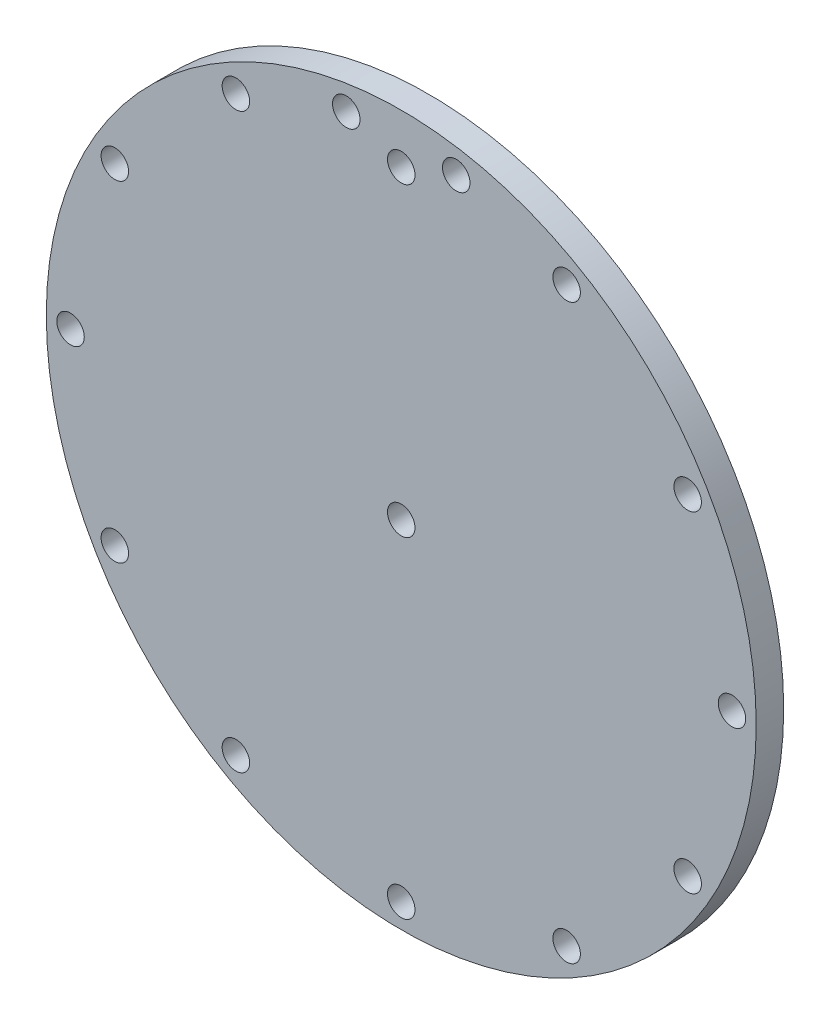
ISO-10303-21;
HEADER;
FILE_DESCRIPTION(('STEP AP214'),'2;1');
FILE_NAME('part.step','',(''),(''),'','','');
FILE_SCHEMA(('AUTOMOTIVE_DESIGN { 1 0 10303 214 1 1 1 1 }'));
ENDSEC;
DATA;
#1=APPLICATION_CONTEXT('core data for automotive mechanical design processes');
#2=APPLICATION_PROTOCOL_DEFINITION('international standard','automotive_design',2000,#1);
#3=PRODUCT_CONTEXT('',#1,'mechanical');
#4=PRODUCT('Part','Part','',(#3));
#5=PRODUCT_RELATED_PRODUCT_CATEGORY('part','',(#4));
#6=PRODUCT_DEFINITION_FORMATION('','',#4);
#7=PRODUCT_DEFINITION_CONTEXT('part definition',#1,'design');
#8=PRODUCT_DEFINITION('design','',#6,#7);
#9=PRODUCT_DEFINITION_SHAPE('','',#8);
#10=(LENGTH_UNIT() NAMED_UNIT(*) SI_UNIT(.MILLI.,.METRE.));
#11=(NAMED_UNIT(*) PLANE_ANGLE_UNIT() SI_UNIT($,.RADIAN.));
#12=(NAMED_UNIT(*) SI_UNIT($,.STERADIAN.) SOLID_ANGLE_UNIT());
#13=UNCERTAINTY_MEASURE_WITH_UNIT(LENGTH_MEASURE(1.E-05),#10,'distance_accuracy_value','');
#14=(GEOMETRIC_REPRESENTATION_CONTEXT(3) GLOBAL_UNCERTAINTY_ASSIGNED_CONTEXT((#13)) GLOBAL_UNIT_ASSIGNED_CONTEXT((#10,
#11,#12)) REPRESENTATION_CONTEXT('',''));
#15=CARTESIAN_POINT('',(0.,0.,0.));
#16=DIRECTION('',(0.,0.,1.));
#17=DIRECTION('',(1.,0.,0.));
#18=AXIS2_PLACEMENT_3D('',#15,#16,#17);
#19=CARTESIAN_POINT('',(0.,0.,3.175));
#20=DIRECTION('',(0.,0.,1.));
#21=DIRECTION('',(1.,0.,0.));
#22=AXIS2_PLACEMENT_3D('',#19,#20,#21);
#23=PLANE('',#22);
#24=CARTESIAN_POINT('',(6.35,37.6685213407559,3.175));
#25=DIRECTION('',(0.,0.,1.));
#26=DIRECTION('',(1.,0.,0.));
#27=AXIS2_PLACEMENT_3D('',#24,#25,#26);
#28=CIRCLE('',#27,1.5875000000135);
#29=CARTESIAN_POINT('',(7.9375000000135,37.6685213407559,3.175));
#30=VERTEX_POINT('',#29);
#31=EDGE_CURVE('E123',#30,#30,#28,.T.);
#32=ORIENTED_EDGE('',*,*,#31,.F.);
#33=EDGE_LOOP('',(#32));
#34=FACE_BOUND('',#33,.T.);
#35=CARTESIAN_POINT('',(33.0821704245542,19.0999999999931,3.175));
#36=DIRECTION('',(0.,0.,1.));
#37=DIRECTION('',(1.,0.,0.));
#38=AXIS2_PLACEMENT_3D('',#35,#36,#37);
#39=CIRCLE('',#38,1.5875000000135);
#40=CARTESIAN_POINT('',(34.6696704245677,19.0999999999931,3.175));
#41=VERTEX_POINT('',#40);
#42=EDGE_CURVE('E111',#41,#41,#39,.T.);
#43=ORIENTED_EDGE('',*,*,#42,.F.);
#44=EDGE_LOOP('',(#43));
#45=FACE_BOUND('',#44,.T.);
#46=CARTESIAN_POINT('',(-33.082170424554,19.0999999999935,3.175));
#47=DIRECTION('',(0.,0.,1.));
#48=DIRECTION('',(1.,0.,0.));
#49=AXIS2_PLACEMENT_3D('',#46,#47,#48);
#50=CIRCLE('',#49,1.58750000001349);
#51=CARTESIAN_POINT('',(-31.4946704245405,19.0999999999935,3.175));
#52=VERTEX_POINT('',#51);
#53=EDGE_CURVE('E99',#52,#52,#50,.T.);
#54=ORIENTED_EDGE('',*,*,#53,.F.);
#55=EDGE_LOOP('',(#54));
#56=FACE_BOUND('',#55,.T.);
#57=CARTESIAN_POINT('',(33.0821704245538,-19.0999999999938,3.175));
#58=DIRECTION('',(0.,0.,1.));
#59=DIRECTION('',(1.,0.,0.));
#60=AXIS2_PLACEMENT_3D('',#57,#58,#59);
#61=CIRCLE('',#60,1.58750000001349);
#62=CARTESIAN_POINT('',(34.6696704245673,-19.0999999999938,3.175));
#63=VERTEX_POINT('',#62);
#64=EDGE_CURVE('E87',#63,#63,#61,.T.);
#65=ORIENTED_EDGE('',*,*,#64,.F.);
#66=EDGE_LOOP('',(#65));
#67=FACE_BOUND('',#66,.T.);
#68=CARTESIAN_POINT('',(0.,-38.1999999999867,3.175));
#69=DIRECTION('',(0.,0.,1.));
#70=DIRECTION('',(1.,0.,0.));
#71=AXIS2_PLACEMENT_3D('',#68,#69,#70);
#72=CIRCLE('',#71,1.58750000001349);
#73=CARTESIAN_POINT('',(1.58750000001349,-38.1999999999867,3.175));
#74=VERTEX_POINT('',#73);
#75=EDGE_CURVE('E75',#74,#74,#72,.T.);
#76=ORIENTED_EDGE('',*,*,#75,.F.);
#77=EDGE_LOOP('',(#76));
#78=FACE_BOUND('',#77,.T.);
#79=CARTESIAN_POINT('',(-33.0821704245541,-19.0999999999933,3.175));
#80=DIRECTION('',(0.,0.,1.));
#81=DIRECTION('',(1.,0.,0.));
#82=AXIS2_PLACEMENT_3D('',#79,#80,#81);
#83=CIRCLE('',#82,1.58750000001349);
#84=CARTESIAN_POINT('',(-31.4946704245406,-19.0999999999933,3.175));
#85=VERTEX_POINT('',#84);
#86=EDGE_CURVE('E63',#85,#85,#83,.T.);
#87=ORIENTED_EDGE('',*,*,#86,.F.);
#88=EDGE_LOOP('',(#87));
#89=FACE_BOUND('',#88,.T.);
#90=CARTESIAN_POINT('',(0.,0.,3.175));
#91=DIRECTION('',(0.,0.,1.));
#92=DIRECTION('',(1.,0.,0.));
#93=AXIS2_PLACEMENT_3D('',#90,#91,#92);
#94=CIRCLE('',#93,1.5875);
#95=CARTESIAN_POINT('',(1.5875,0.,3.175));
#96=VERTEX_POINT('',#95);
#97=EDGE_CURVE('E51',#96,#96,#94,.T.);
#98=ORIENTED_EDGE('',*,*,#97,.F.);
#99=EDGE_LOOP('',(#98));
#100=FACE_BOUND('',#99,.T.);
#101=CARTESIAN_POINT('',(0.,0.,3.175));
#102=DIRECTION('',(0.,0.,1.));
#103=DIRECTION('',(1.,0.,0.));
#104=AXIS2_PLACEMENT_3D('',#101,#102,#103);
#105=CIRCLE('',#104,41.);
#106=CARTESIAN_POINT('',(41.,0.,3.175));
#107=VERTEX_POINT('',#106);
#108=EDGE_CURVE('E10',#107,#107,#105,.T.);
#109=ORIENTED_EDGE('',*,*,#108,.T.);
#110=EDGE_LOOP('',(#109));
#111=FACE_BOUND('',#110,.T.);
#112=CARTESIAN_POINT('',(0.,35.2924110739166,3.175));
#113=DIRECTION('',(0.,0.,1.));
#114=DIRECTION('',(1.,0.,0.));
#115=AXIS2_PLACEMENT_3D('',#112,#113,#114);
#116=CIRCLE('',#115,1.5875);
#117=CARTESIAN_POINT('',(1.5875,35.2924110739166,3.175));
#118=VERTEX_POINT('',#117);
#119=EDGE_CURVE('E46',#118,#118,#116,.T.);
#120=ORIENTED_EDGE('',*,*,#119,.F.);
#121=EDGE_LOOP('',(#120));
#122=FACE_BOUND('',#121,.T.);
#123=CARTESIAN_POINT('',(-38.1999999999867,1.33374587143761E-13,3.175));
#124=DIRECTION('',(0.,0.,1.));
#125=DIRECTION('',(1.,0.,0.));
#126=AXIS2_PLACEMENT_3D('',#123,#124,#125);
#127=CIRCLE('',#126,1.58750000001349);
#128=CARTESIAN_POINT('',(-36.6124999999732,1.33374587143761E-13,3.175));
#129=VERTEX_POINT('',#128);
#130=EDGE_CURVE('E57',#129,#129,#127,.T.);
#131=ORIENTED_EDGE('',*,*,#130,.F.);
#132=EDGE_LOOP('',(#131));
#133=FACE_BOUND('',#132,.T.);
#134=CARTESIAN_POINT('',(-19.0999999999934,-33.082170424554,3.175));
#135=DIRECTION('',(0.,0.,1.));
#136=DIRECTION('',(1.,0.,0.));
#137=AXIS2_PLACEMENT_3D('',#134,#135,#136);
#138=CIRCLE('',#137,1.58750000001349);
#139=CARTESIAN_POINT('',(-17.5124999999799,-33.082170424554,3.175));
#140=VERTEX_POINT('',#139);
#141=EDGE_CURVE('E69',#140,#140,#138,.T.);
#142=ORIENTED_EDGE('',*,*,#141,.F.);
#143=EDGE_LOOP('',(#142));
#144=FACE_BOUND('',#143,.T.);
#145=CARTESIAN_POINT('',(19.0999999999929,-33.0821704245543,3.175));
#146=DIRECTION('',(0.,0.,1.));
#147=DIRECTION('',(1.,0.,0.));
#148=AXIS2_PLACEMENT_3D('',#145,#146,#147);
#149=CIRCLE('',#148,1.58750000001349);
#150=CARTESIAN_POINT('',(20.6875000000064,-33.0821704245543,3.175));
#151=VERTEX_POINT('',#150);
#152=EDGE_CURVE('E81',#151,#151,#149,.T.);
#153=ORIENTED_EDGE('',*,*,#152,.F.);
#154=EDGE_LOOP('',(#153));
#155=FACE_BOUND('',#154,.T.);
#156=CARTESIAN_POINT('',(38.1999999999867,-4.00123761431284E-13,3.175));
#157=DIRECTION('',(0.,0.,1.));
#158=DIRECTION('',(1.,0.,0.));
#159=AXIS2_PLACEMENT_3D('',#156,#157,#158);
#160=CIRCLE('',#159,1.58750000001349);
#161=CARTESIAN_POINT('',(39.7875000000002,-4.00123761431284E-13,3.175));
#162=VERTEX_POINT('',#161);
#163=EDGE_CURVE('E93',#162,#162,#160,.T.);
#164=ORIENTED_EDGE('',*,*,#163,.F.);
#165=EDGE_LOOP('',(#164));
#166=FACE_BOUND('',#165,.T.);
#167=CARTESIAN_POINT('',(-19.0999999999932,33.0821704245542,3.175));
#168=DIRECTION('',(0.,0.,1.));
#169=DIRECTION('',(1.,0.,0.));
#170=AXIS2_PLACEMENT_3D('',#167,#168,#169);
#171=CIRCLE('',#170,1.5875000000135);
#172=CARTESIAN_POINT('',(-17.5124999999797,33.0821704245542,3.175));
#173=VERTEX_POINT('',#172);
#174=EDGE_CURVE('E105',#173,#173,#171,.T.);
#175=ORIENTED_EDGE('',*,*,#174,.F.);
#176=EDGE_LOOP('',(#175));
#177=FACE_BOUND('',#176,.T.);
#178=CARTESIAN_POINT('',(19.0999999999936,33.0821704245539,3.175));
#179=DIRECTION('',(0.,0.,1.));
#180=DIRECTION('',(1.,0.,0.));
#181=AXIS2_PLACEMENT_3D('',#178,#179,#180);
#182=CIRCLE('',#181,1.58750000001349);
#183=CARTESIAN_POINT('',(20.6875000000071,33.0821704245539,3.175));
#184=VERTEX_POINT('',#183);
#185=EDGE_CURVE('E117',#184,#184,#182,.T.);
#186=ORIENTED_EDGE('',*,*,#185,.F.);
#187=EDGE_LOOP('',(#186));
#188=FACE_BOUND('',#187,.T.);
#189=CARTESIAN_POINT('',(-6.35,37.6685213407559,3.175));
#190=DIRECTION('',(0.,0.,1.));
#191=DIRECTION('',(1.,0.,0.));
#192=AXIS2_PLACEMENT_3D('',#189,#190,#191);
#193=CIRCLE('',#192,1.58750000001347);
#194=CARTESIAN_POINT('',(-4.76249999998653,37.6685213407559,3.175));
#195=VERTEX_POINT('',#194);
#196=EDGE_CURVE('E129',#195,#195,#193,.T.);
#197=ORIENTED_EDGE('',*,*,#196,.F.);
#198=EDGE_LOOP('',(#197));
#199=FACE_BOUND('',#198,.T.);
#200=ADVANCED_FACE('F35',(#34,#45,#56,#67,#78,#89,#100,#111,#122,#133,#144,#155,#166,#177,#188,
#199),#23,.T.);
#201=CARTESIAN_POINT('',(0.,0.,0.));
#202=DIRECTION('',(0.,0.,1.));
#203=DIRECTION('',(1.,0.,0.));
#204=AXIS2_PLACEMENT_3D('',#201,#202,#203);
#205=PLANE('',#204);
#206=CARTESIAN_POINT('',(0.,0.,0.));
#207=DIRECTION('',(0.,0.,1.));
#208=DIRECTION('',(1.,0.,0.));
#209=AXIS2_PLACEMENT_3D('',#206,#207,#208);
#210=CIRCLE('',#209,41.);
#211=CARTESIAN_POINT('',(41.,0.,0.));
#212=VERTEX_POINT('',#211);
#213=EDGE_CURVE('E39',#212,#212,#210,.T.);
#214=ORIENTED_EDGE('',*,*,#213,.F.);
#215=EDGE_LOOP('',(#214));
#216=FACE_BOUND('',#215,.T.);
#217=CARTESIAN_POINT('',(0.,35.2924110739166,0.));
#218=DIRECTION('',(0.,0.,1.));
#219=DIRECTION('',(1.,0.,0.));
#220=AXIS2_PLACEMENT_3D('',#217,#218,#219);
#221=CIRCLE('',#220,1.5875);
#222=CARTESIAN_POINT('',(1.5875,35.2924110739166,0.));
#223=VERTEX_POINT('',#222);
#224=EDGE_CURVE('E48',#223,#223,#221,.T.);
#225=ORIENTED_EDGE('',*,*,#224,.T.);
#226=EDGE_LOOP('',(#225));
#227=FACE_BOUND('',#226,.T.);
#228=CARTESIAN_POINT('',(0.,0.,0.));
#229=DIRECTION('',(0.,0.,1.));
#230=DIRECTION('',(1.,0.,0.));
#231=AXIS2_PLACEMENT_3D('',#228,#229,#230);
#232=CIRCLE('',#231,1.5875);
#233=CARTESIAN_POINT('',(1.5875,0.,0.));
#234=VERTEX_POINT('',#233);
#235=EDGE_CURVE('E54',#234,#234,#232,.T.);
#236=ORIENTED_EDGE('',*,*,#235,.T.);
#237=EDGE_LOOP('',(#236));
#238=FACE_BOUND('',#237,.T.);
#239=CARTESIAN_POINT('',(-38.1999999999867,1.33374587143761E-13,0.));
#240=DIRECTION('',(0.,0.,1.));
#241=DIRECTION('',(1.,0.,0.));
#242=AXIS2_PLACEMENT_3D('',#239,#240,#241);
#243=CIRCLE('',#242,1.58750000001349);
#244=CARTESIAN_POINT('',(-36.6124999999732,1.33374587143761E-13,0.));
#245=VERTEX_POINT('',#244);
#246=EDGE_CURVE('E60',#245,#245,#243,.T.);
#247=ORIENTED_EDGE('',*,*,#246,.T.);
#248=EDGE_LOOP('',(#247));
#249=FACE_BOUND('',#248,.T.);
#250=CARTESIAN_POINT('',(-33.0821704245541,-19.0999999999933,0.));
#251=DIRECTION('',(0.,0.,1.));
#252=DIRECTION('',(1.,0.,0.));
#253=AXIS2_PLACEMENT_3D('',#250,#251,#252);
#254=CIRCLE('',#253,1.58750000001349);
#255=CARTESIAN_POINT('',(-31.4946704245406,-19.0999999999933,0.));
#256=VERTEX_POINT('',#255);
#257=EDGE_CURVE('E66',#256,#256,#254,.T.);
#258=ORIENTED_EDGE('',*,*,#257,.T.);
#259=EDGE_LOOP('',(#258));
#260=FACE_BOUND('',#259,.T.);
#261=CARTESIAN_POINT('',(-19.0999999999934,-33.082170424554,0.));
#262=DIRECTION('',(0.,0.,1.));
#263=DIRECTION('',(1.,0.,0.));
#264=AXIS2_PLACEMENT_3D('',#261,#262,#263);
#265=CIRCLE('',#264,1.58750000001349);
#266=CARTESIAN_POINT('',(-17.5124999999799,-33.082170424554,0.));
#267=VERTEX_POINT('',#266);
#268=EDGE_CURVE('E72',#267,#267,#265,.T.);
#269=ORIENTED_EDGE('',*,*,#268,.T.);
#270=EDGE_LOOP('',(#269));
#271=FACE_BOUND('',#270,.T.);
#272=CARTESIAN_POINT('',(0.,-38.1999999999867,0.));
#273=DIRECTION('',(0.,0.,1.));
#274=DIRECTION('',(1.,0.,0.));
#275=AXIS2_PLACEMENT_3D('',#272,#273,#274);
#276=CIRCLE('',#275,1.58750000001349);
#277=CARTESIAN_POINT('',(1.58750000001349,-38.1999999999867,0.));
#278=VERTEX_POINT('',#277);
#279=EDGE_CURVE('E78',#278,#278,#276,.T.);
#280=ORIENTED_EDGE('',*,*,#279,.T.);
#281=EDGE_LOOP('',(#280));
#282=FACE_BOUND('',#281,.T.);
#283=CARTESIAN_POINT('',(19.0999999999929,-33.0821704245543,0.));
#284=DIRECTION('',(0.,0.,1.));
#285=DIRECTION('',(1.,0.,0.));
#286=AXIS2_PLACEMENT_3D('',#283,#284,#285);
#287=CIRCLE('',#286,1.58750000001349);
#288=CARTESIAN_POINT('',(20.6875000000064,-33.0821704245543,0.));
#289=VERTEX_POINT('',#288);
#290=EDGE_CURVE('E84',#289,#289,#287,.T.);
#291=ORIENTED_EDGE('',*,*,#290,.T.);
#292=EDGE_LOOP('',(#291));
#293=FACE_BOUND('',#292,.T.);
#294=CARTESIAN_POINT('',(33.0821704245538,-19.0999999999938,0.));
#295=DIRECTION('',(0.,0.,1.));
#296=DIRECTION('',(1.,0.,0.));
#297=AXIS2_PLACEMENT_3D('',#294,#295,#296);
#298=CIRCLE('',#297,1.58750000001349);
#299=CARTESIAN_POINT('',(34.6696704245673,-19.0999999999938,0.));
#300=VERTEX_POINT('',#299);
#301=EDGE_CURVE('E90',#300,#300,#298,.T.);
#302=ORIENTED_EDGE('',*,*,#301,.T.);
#303=EDGE_LOOP('',(#302));
#304=FACE_BOUND('',#303,.T.);
#305=CARTESIAN_POINT('',(38.1999999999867,-4.00123761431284E-13,0.));
#306=DIRECTION('',(0.,0.,1.));
#307=DIRECTION('',(1.,0.,0.));
#308=AXIS2_PLACEMENT_3D('',#305,#306,#307);
#309=CIRCLE('',#308,1.58750000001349);
#310=CARTESIAN_POINT('',(39.7875000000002,-4.00123761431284E-13,0.));
#311=VERTEX_POINT('',#310);
#312=EDGE_CURVE('E96',#311,#311,#309,.T.);
#313=ORIENTED_EDGE('',*,*,#312,.T.);
#314=EDGE_LOOP('',(#313));
#315=FACE_BOUND('',#314,.T.);
#316=CARTESIAN_POINT('',(-33.082170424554,19.0999999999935,0.));
#317=DIRECTION('',(0.,0.,1.));
#318=DIRECTION('',(1.,0.,0.));
#319=AXIS2_PLACEMENT_3D('',#316,#317,#318);
#320=CIRCLE('',#319,1.58750000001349);
#321=CARTESIAN_POINT('',(-31.4946704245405,19.0999999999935,0.));
#322=VERTEX_POINT('',#321);
#323=EDGE_CURVE('E102',#322,#322,#320,.T.);
#324=ORIENTED_EDGE('',*,*,#323,.T.);
#325=EDGE_LOOP('',(#324));
#326=FACE_BOUND('',#325,.T.);
#327=CARTESIAN_POINT('',(-19.0999999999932,33.0821704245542,0.));
#328=DIRECTION('',(0.,0.,1.));
#329=DIRECTION('',(1.,0.,0.));
#330=AXIS2_PLACEMENT_3D('',#327,#328,#329);
#331=CIRCLE('',#330,1.5875000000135);
#332=CARTESIAN_POINT('',(-17.5124999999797,33.0821704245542,0.));
#333=VERTEX_POINT('',#332);
#334=EDGE_CURVE('E108',#333,#333,#331,.T.);
#335=ORIENTED_EDGE('',*,*,#334,.T.);
#336=EDGE_LOOP('',(#335));
#337=FACE_BOUND('',#336,.T.);
#338=CARTESIAN_POINT('',(33.0821704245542,19.0999999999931,0.));
#339=DIRECTION('',(0.,0.,1.));
#340=DIRECTION('',(1.,0.,0.));
#341=AXIS2_PLACEMENT_3D('',#338,#339,#340);
#342=CIRCLE('',#341,1.5875000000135);
#343=CARTESIAN_POINT('',(34.6696704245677,19.0999999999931,0.));
#344=VERTEX_POINT('',#343);
#345=EDGE_CURVE('E114',#344,#344,#342,.T.);
#346=ORIENTED_EDGE('',*,*,#345,.T.);
#347=EDGE_LOOP('',(#346));
#348=FACE_BOUND('',#347,.T.);
#349=CARTESIAN_POINT('',(19.0999999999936,33.0821704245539,0.));
#350=DIRECTION('',(0.,0.,1.));
#351=DIRECTION('',(1.,0.,0.));
#352=AXIS2_PLACEMENT_3D('',#349,#350,#351);
#353=CIRCLE('',#352,1.58750000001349);
#354=CARTESIAN_POINT('',(20.6875000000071,33.0821704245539,0.));
#355=VERTEX_POINT('',#354);
#356=EDGE_CURVE('E120',#355,#355,#353,.T.);
#357=ORIENTED_EDGE('',*,*,#356,.T.);
#358=EDGE_LOOP('',(#357));
#359=FACE_BOUND('',#358,.T.);
#360=CARTESIAN_POINT('',(6.35,37.6685213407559,0.));
#361=DIRECTION('',(0.,0.,1.));
#362=DIRECTION('',(1.,0.,0.));
#363=AXIS2_PLACEMENT_3D('',#360,#361,#362);
#364=CIRCLE('',#363,1.5875000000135);
#365=CARTESIAN_POINT('',(7.9375000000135,37.6685213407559,0.));
#366=VERTEX_POINT('',#365);
#367=EDGE_CURVE('E126',#366,#366,#364,.T.);
#368=ORIENTED_EDGE('',*,*,#367,.T.);
#369=EDGE_LOOP('',(#368));
#370=FACE_BOUND('',#369,.T.);
#371=CARTESIAN_POINT('',(-6.35,37.6685213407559,0.));
#372=DIRECTION('',(0.,0.,1.));
#373=DIRECTION('',(1.,0.,0.));
#374=AXIS2_PLACEMENT_3D('',#371,#372,#373);
#375=CIRCLE('',#374,1.58750000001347);
#376=CARTESIAN_POINT('',(-4.76249999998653,37.6685213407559,0.));
#377=VERTEX_POINT('',#376);
#378=EDGE_CURVE('E132',#377,#377,#375,.T.);
#379=ORIENTED_EDGE('',*,*,#378,.T.);
#380=EDGE_LOOP('',(#379));
#381=FACE_BOUND('',#380,.T.);
#382=ADVANCED_FACE('F142',(#216,#227,#238,#249,#260,#271,#282,#293,#304,#315,#326,#337,#348,
#359,#370,#381),#205,.F.);
#383=CARTESIAN_POINT('',(0.,0.,3.175));
#384=DIRECTION('',(0.,0.,-1.));
#385=DIRECTION('',(-1.,0.,0.));
#386=AXIS2_PLACEMENT_3D('',#383,#384,#385);
#387=CYLINDRICAL_SURFACE('',#386,41.);
#388=ORIENTED_EDGE('',*,*,#108,.F.);
#389=EDGE_LOOP('',(#388));
#390=FACE_BOUND('',#389,.T.);
#391=ORIENTED_EDGE('',*,*,#213,.T.);
#392=EDGE_LOOP('',(#391));
#393=FACE_BOUND('',#392,.T.);
#394=ADVANCED_FACE('F37',(#390,#393),#387,.T.);
#395=CARTESIAN_POINT('',(0.,35.2924110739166,3.175));
#396=DIRECTION('',(0.,0.,-1.));
#397=DIRECTION('',(-1.,0.,0.));
#398=AXIS2_PLACEMENT_3D('',#395,#396,#397);
#399=CYLINDRICAL_SURFACE('',#398,1.5875);
#400=ORIENTED_EDGE('',*,*,#119,.T.);
#401=EDGE_LOOP('',(#400));
#402=FACE_BOUND('',#401,.T.);
#403=ORIENTED_EDGE('',*,*,#224,.F.);
#404=EDGE_LOOP('',(#403));
#405=FACE_BOUND('',#404,.T.);
#406=ADVANCED_FACE('F152',(#402,#405),#399,.F.);
#407=CARTESIAN_POINT('',(0.,0.,3.175));
#408=DIRECTION('',(0.,0.,-1.));
#409=DIRECTION('',(-1.,0.,0.));
#410=AXIS2_PLACEMENT_3D('',#407,#408,#409);
#411=CYLINDRICAL_SURFACE('',#410,1.5875);
#412=ORIENTED_EDGE('',*,*,#97,.T.);
#413=EDGE_LOOP('',(#412));
#414=FACE_BOUND('',#413,.T.);
#415=ORIENTED_EDGE('',*,*,#235,.F.);
#416=EDGE_LOOP('',(#415));
#417=FACE_BOUND('',#416,.T.);
#418=ADVANCED_FACE('F155',(#414,#417),#411,.F.);
#419=CARTESIAN_POINT('',(-38.1999999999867,1.33374587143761E-13,3.175));
#420=DIRECTION('',(0.,0.,-1.));
#421=DIRECTION('',(-1.,0.,0.));
#422=AXIS2_PLACEMENT_3D('',#419,#420,#421);
#423=CYLINDRICAL_SURFACE('',#422,1.58750000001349);
#424=ORIENTED_EDGE('',*,*,#130,.T.);
#425=EDGE_LOOP('',(#424));
#426=FACE_BOUND('',#425,.T.);
#427=ORIENTED_EDGE('',*,*,#246,.F.);
#428=EDGE_LOOP('',(#427));
#429=FACE_BOUND('',#428,.T.);
#430=ADVANCED_FACE('F159',(#426,#429),#423,.F.);
#431=CARTESIAN_POINT('',(-33.0821704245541,-19.0999999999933,3.175));
#432=DIRECTION('',(0.,0.,-1.));
#433=DIRECTION('',(-1.,0.,0.));
#434=AXIS2_PLACEMENT_3D('',#431,#432,#433);
#435=CYLINDRICAL_SURFACE('',#434,1.58750000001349);
#436=ORIENTED_EDGE('',*,*,#86,.T.);
#437=EDGE_LOOP('',(#436));
#438=FACE_BOUND('',#437,.T.);
#439=ORIENTED_EDGE('',*,*,#257,.F.);
#440=EDGE_LOOP('',(#439));
#441=FACE_BOUND('',#440,.T.);
#442=ADVANCED_FACE('F163',(#438,#441),#435,.F.);
#443=CARTESIAN_POINT('',(-19.0999999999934,-33.082170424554,3.175));
#444=DIRECTION('',(0.,0.,-1.));
#445=DIRECTION('',(-1.,0.,0.));
#446=AXIS2_PLACEMENT_3D('',#443,#444,#445);
#447=CYLINDRICAL_SURFACE('',#446,1.58750000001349);
#448=ORIENTED_EDGE('',*,*,#141,.T.);
#449=EDGE_LOOP('',(#448));
#450=FACE_BOUND('',#449,.T.);
#451=ORIENTED_EDGE('',*,*,#268,.F.);
#452=EDGE_LOOP('',(#451));
#453=FACE_BOUND('',#452,.T.);
#454=ADVANCED_FACE('F167',(#450,#453),#447,.F.);
#455=CARTESIAN_POINT('',(0.,-38.1999999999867,3.175));
#456=DIRECTION('',(0.,0.,-1.));
#457=DIRECTION('',(-1.,0.,0.));
#458=AXIS2_PLACEMENT_3D('',#455,#456,#457);
#459=CYLINDRICAL_SURFACE('',#458,1.58750000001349);
#460=ORIENTED_EDGE('',*,*,#75,.T.);
#461=EDGE_LOOP('',(#460));
#462=FACE_BOUND('',#461,.T.);
#463=ORIENTED_EDGE('',*,*,#279,.F.);
#464=EDGE_LOOP('',(#463));
#465=FACE_BOUND('',#464,.T.);
#466=ADVANCED_FACE('F171',(#462,#465),#459,.F.);
#467=CARTESIAN_POINT('',(19.0999999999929,-33.0821704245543,3.175));
#468=DIRECTION('',(0.,0.,-1.));
#469=DIRECTION('',(-1.,0.,0.));
#470=AXIS2_PLACEMENT_3D('',#467,#468,#469);
#471=CYLINDRICAL_SURFACE('',#470,1.58750000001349);
#472=ORIENTED_EDGE('',*,*,#152,.T.);
#473=EDGE_LOOP('',(#472));
#474=FACE_BOUND('',#473,.T.);
#475=ORIENTED_EDGE('',*,*,#290,.F.);
#476=EDGE_LOOP('',(#475));
#477=FACE_BOUND('',#476,.T.);
#478=ADVANCED_FACE('F175',(#474,#477),#471,.F.);
#479=CARTESIAN_POINT('',(33.0821704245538,-19.0999999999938,3.175));
#480=DIRECTION('',(0.,0.,-1.));
#481=DIRECTION('',(-1.,0.,0.));
#482=AXIS2_PLACEMENT_3D('',#479,#480,#481);
#483=CYLINDRICAL_SURFACE('',#482,1.58750000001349);
#484=ORIENTED_EDGE('',*,*,#64,.T.);
#485=EDGE_LOOP('',(#484));
#486=FACE_BOUND('',#485,.T.);
#487=ORIENTED_EDGE('',*,*,#301,.F.);
#488=EDGE_LOOP('',(#487));
#489=FACE_BOUND('',#488,.T.);
#490=ADVANCED_FACE('F179',(#486,#489),#483,.F.);
#491=CARTESIAN_POINT('',(38.1999999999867,-4.00123761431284E-13,3.175));
#492=DIRECTION('',(0.,0.,-1.));
#493=DIRECTION('',(-1.,0.,0.));
#494=AXIS2_PLACEMENT_3D('',#491,#492,#493);
#495=CYLINDRICAL_SURFACE('',#494,1.58750000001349);
#496=ORIENTED_EDGE('',*,*,#163,.T.);
#497=EDGE_LOOP('',(#496));
#498=FACE_BOUND('',#497,.T.);
#499=ORIENTED_EDGE('',*,*,#312,.F.);
#500=EDGE_LOOP('',(#499));
#501=FACE_BOUND('',#500,.T.);
#502=ADVANCED_FACE('F183',(#498,#501),#495,.F.);
#503=CARTESIAN_POINT('',(-33.082170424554,19.0999999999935,3.175));
#504=DIRECTION('',(0.,0.,-1.));
#505=DIRECTION('',(-1.,0.,0.));
#506=AXIS2_PLACEMENT_3D('',#503,#504,#505);
#507=CYLINDRICAL_SURFACE('',#506,1.58750000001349);
#508=ORIENTED_EDGE('',*,*,#53,.T.);
#509=EDGE_LOOP('',(#508));
#510=FACE_BOUND('',#509,.T.);
#511=ORIENTED_EDGE('',*,*,#323,.F.);
#512=EDGE_LOOP('',(#511));
#513=FACE_BOUND('',#512,.T.);
#514=ADVANCED_FACE('F187',(#510,#513),#507,.F.);
#515=CARTESIAN_POINT('',(-19.0999999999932,33.0821704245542,3.175));
#516=DIRECTION('',(0.,0.,-1.));
#517=DIRECTION('',(-1.,0.,0.));
#518=AXIS2_PLACEMENT_3D('',#515,#516,#517);
#519=CYLINDRICAL_SURFACE('',#518,1.5875000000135);
#520=ORIENTED_EDGE('',*,*,#174,.T.);
#521=EDGE_LOOP('',(#520));
#522=FACE_BOUND('',#521,.T.);
#523=ORIENTED_EDGE('',*,*,#334,.F.);
#524=EDGE_LOOP('',(#523));
#525=FACE_BOUND('',#524,.T.);
#526=ADVANCED_FACE('F191',(#522,#525),#519,.F.);
#527=CARTESIAN_POINT('',(33.0821704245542,19.0999999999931,3.175));
#528=DIRECTION('',(0.,0.,-1.));
#529=DIRECTION('',(-1.,0.,0.));
#530=AXIS2_PLACEMENT_3D('',#527,#528,#529);
#531=CYLINDRICAL_SURFACE('',#530,1.5875000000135);
#532=ORIENTED_EDGE('',*,*,#42,.T.);
#533=EDGE_LOOP('',(#532));
#534=FACE_BOUND('',#533,.T.);
#535=ORIENTED_EDGE('',*,*,#345,.F.);
#536=EDGE_LOOP('',(#535));
#537=FACE_BOUND('',#536,.T.);
#538=ADVANCED_FACE('F195',(#534,#537),#531,.F.);
#539=CARTESIAN_POINT('',(19.0999999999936,33.0821704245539,3.175));
#540=DIRECTION('',(0.,0.,-1.));
#541=DIRECTION('',(-1.,0.,0.));
#542=AXIS2_PLACEMENT_3D('',#539,#540,#541);
#543=CYLINDRICAL_SURFACE('',#542,1.58750000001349);
#544=ORIENTED_EDGE('',*,*,#185,.T.);
#545=EDGE_LOOP('',(#544));
#546=FACE_BOUND('',#545,.T.);
#547=ORIENTED_EDGE('',*,*,#356,.F.);
#548=EDGE_LOOP('',(#547));
#549=FACE_BOUND('',#548,.T.);
#550=ADVANCED_FACE('F199',(#546,#549),#543,.F.);
#551=CARTESIAN_POINT('',(6.35,37.6685213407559,3.175));
#552=DIRECTION('',(0.,0.,-1.));
#553=DIRECTION('',(-1.,0.,0.));
#554=AXIS2_PLACEMENT_3D('',#551,#552,#553);
#555=CYLINDRICAL_SURFACE('',#554,1.5875000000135);
#556=ORIENTED_EDGE('',*,*,#31,.T.);
#557=EDGE_LOOP('',(#556));
#558=FACE_BOUND('',#557,.T.);
#559=ORIENTED_EDGE('',*,*,#367,.F.);
#560=EDGE_LOOP('',(#559));
#561=FACE_BOUND('',#560,.T.);
#562=ADVANCED_FACE('F203',(#558,#561),#555,.F.);
#563=CARTESIAN_POINT('',(-6.35,37.6685213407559,3.175));
#564=DIRECTION('',(0.,0.,-1.));
#565=DIRECTION('',(-1.,0.,0.));
#566=AXIS2_PLACEMENT_3D('',#563,#564,#565);
#567=CYLINDRICAL_SURFACE('',#566,1.58750000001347);
#568=ORIENTED_EDGE('',*,*,#196,.T.);
#569=EDGE_LOOP('',(#568));
#570=FACE_BOUND('',#569,.T.);
#571=ORIENTED_EDGE('',*,*,#378,.F.);
#572=EDGE_LOOP('',(#571));
#573=FACE_BOUND('',#572,.T.);
#574=ADVANCED_FACE('F138',(#570,#573),#567,.F.);
#575=CLOSED_SHELL('',(#200,#382,#394,#406,#418,#430,#442,#454,#466,#478,#490,#502,#514,#526,
#538,#550,#562,#574));
#576=MANIFOLD_SOLID_BREP('B2',#575);
#577=ADVANCED_BREP_SHAPE_REPRESENTATION('',(#18,#576),#14);
#578=SHAPE_DEFINITION_REPRESENTATION(#9,#577);
ENDSEC;
END-ISO-10303-21;
